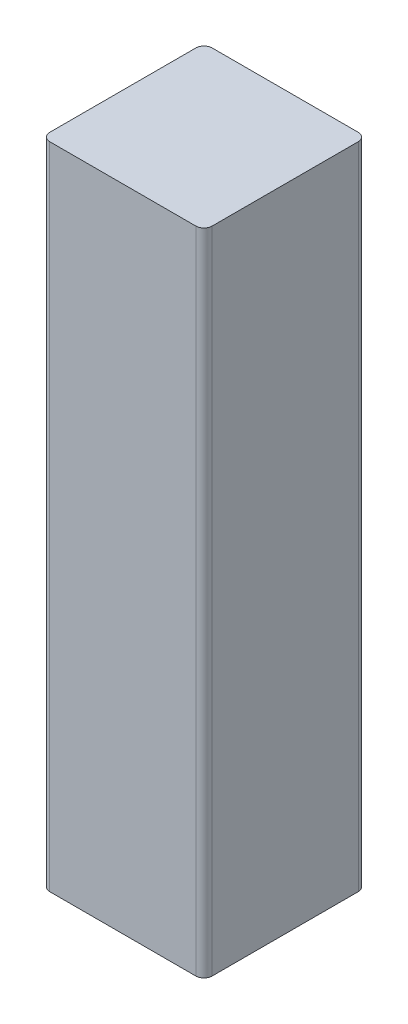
from build123d import *

# Parameters (mm, degrees)
BOSS_EXTRU_1_DEPTH = 40


with BuildPart() as part:
    # Esquisse1 → Boss.-Extru.1 (new body)
    with BuildSketch(Plane(origin=(0, 20, 0), x_dir=(1, 0, 0), z_dir=(0, 1, 0))):
        with BuildLine():
            Line((-4.5, -5), (4.5, -5))
            ThreePointArc((4.5, -5), (4.853553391, -4.853553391), (5, -4.5))
            Line((5, -4.5), (5, 4.5))
            ThreePointArc((5, 4.5), (4.853553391, 4.853553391), (4.5, 5))
            Line((4.5, 5), (-4.5, 5))
            ThreePointArc((-4.5, 5), (-4.853553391, 4.853553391), (-5, 4.5))
            Line((-5, 4.5), (-5, -4.5))
            ThreePointArc((-5, -4.5), (-4.853553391, -4.853553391), (-4.5, -5))
        make_face()
    extrude(amount=-BOSS_EXTRU_1_DEPTH)


solid = part.part
